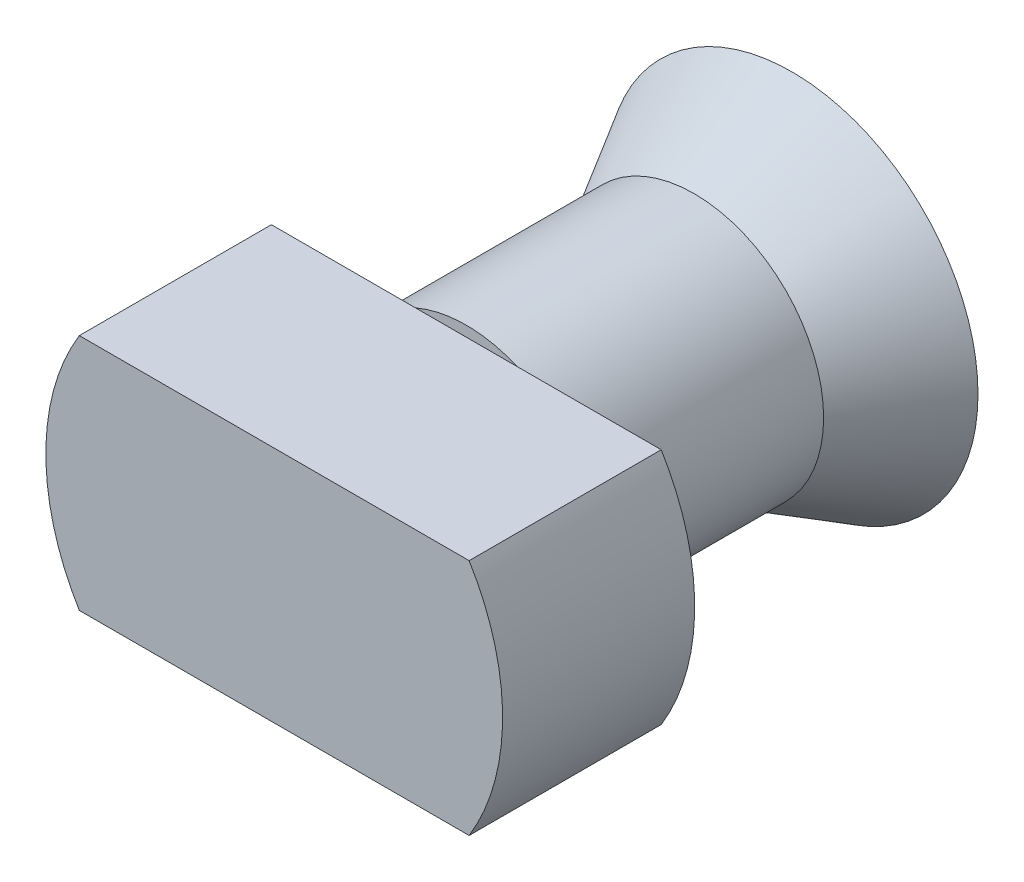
from build123d import *

# Parameters (mm, degrees)
CUT_EXTRUDE_START   = -2.3368
CUT_EXTRUDE_1_DEPTH = 2.3368


with BuildPart() as part:
    # Sketch 1 → Revolve 1 (revolve)
    with BuildSketch(Plane(origin=(0, 0, 0), x_dir=(0, 0, -1), z_dir=(1, 0, 0)), mode=Mode.PRIVATE) as revolve_1_sk:
        Polygon((0, 0), (0, 2.778125), (2.3368, 2.778125), (2.3368, 1.5748), (5.108575, 1.5748), (6.2992, 2.262207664), (6.2992, 0), align=None)
    revolve(revolve_1_sk.sketch.rotate(Axis((0, 0, 0), (0, 0, -1)), 90), axis=Axis((0, 0, 0), (0, 0, -1)))

    # Sketch 2 → Cut-Extrude 1 (cut)
    with BuildSketch(Plane.XY.offset(CUT_EXTRUDE_START)):
        with BuildLine():
            Line((-2.371044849, 1.4478), (2.371044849, 1.4478))
            ThreePointArc((2.371044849, 1.4478), (0, 2.778125), (-2.371044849, 1.4478))
        make_face()
        with BuildLine():
            Line((2.371044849, -1.4478), (-2.371044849, -1.4478))
            ThreePointArc((-2.371044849, -1.4478), (0, -2.778125), (2.371044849, -1.4478))
        make_face()
    extrude(amount=CUT_EXTRUDE_1_DEPTH, mode=Mode.SUBTRACT)


solid = part.part
